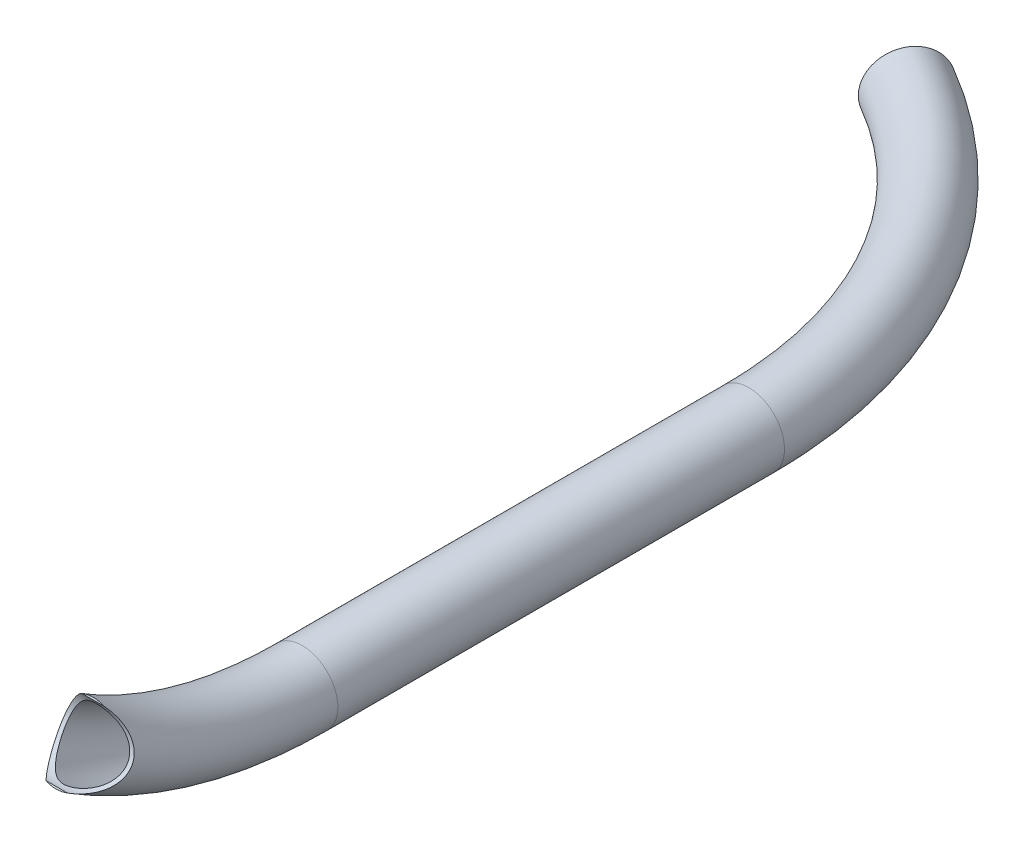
ISO-10303-21;
HEADER;
FILE_DESCRIPTION(('STEP AP214'),'2;1');
FILE_NAME('part.step','',(''),(''),'','','');
FILE_SCHEMA(('AUTOMOTIVE_DESIGN { 1 0 10303 214 1 1 1 1 }'));
ENDSEC;
DATA;
#1=APPLICATION_CONTEXT('core data for automotive mechanical design processes');
#2=APPLICATION_PROTOCOL_DEFINITION('international standard','automotive_design',2000,#1);
#3=PRODUCT_CONTEXT('',#1,'mechanical');
#4=PRODUCT('Part','Part','',(#3));
#5=PRODUCT_RELATED_PRODUCT_CATEGORY('part','',(#4));
#6=PRODUCT_DEFINITION_FORMATION('','',#4);
#7=PRODUCT_DEFINITION_CONTEXT('part definition',#1,'design');
#8=PRODUCT_DEFINITION('design','',#6,#7);
#9=PRODUCT_DEFINITION_SHAPE('','',#8);
#10=(LENGTH_UNIT() NAMED_UNIT(*) SI_UNIT(.MILLI.,.METRE.));
#11=(NAMED_UNIT(*) PLANE_ANGLE_UNIT() SI_UNIT($,.RADIAN.));
#12=(NAMED_UNIT(*) SI_UNIT($,.STERADIAN.) SOLID_ANGLE_UNIT());
#13=UNCERTAINTY_MEASURE_WITH_UNIT(LENGTH_MEASURE(1.E-05),#10,'distance_accuracy_value','');
#14=(GEOMETRIC_REPRESENTATION_CONTEXT(3) GLOBAL_UNCERTAINTY_ASSIGNED_CONTEXT((#13)) GLOBAL_UNIT_ASSIGNED_CONTEXT((#10,
#11,#12)) REPRESENTATION_CONTEXT('',''));
#15=CARTESIAN_POINT('',(0.,0.,0.));
#16=DIRECTION('',(0.,0.,1.));
#17=DIRECTION('',(1.,0.,0.));
#18=AXIS2_PLACEMENT_3D('',#15,#16,#17);
#19=CARTESIAN_POINT('',(200.000000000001,200.,0.));
#20=DIRECTION('',(1.,0.,0.));
#21=DIRECTION('',(0.,0.,1.));
#22=AXIS2_PLACEMENT_3D('',#19,#20,#21);
#23=TOROIDAL_SURFACE('',#22,200.,16.5);
#24=CARTESIAN_POINT('',(200.000000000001,0.,0.));
#25=DIRECTION('',(0.,0.,-1.));
#26=DIRECTION('',(-1.,0.,0.));
#27=AXIS2_PLACEMENT_3D('',#24,#25,#26);
#28=CIRCLE('',#27,16.5);
#29=CARTESIAN_POINT('',(183.500000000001,0.,0.));
#30=VERTEX_POINT('',#29);
#31=EDGE_CURVE('E93',#30,#30,#28,.T.);
#32=ORIENTED_EDGE('',*,*,#31,.F.);
#33=EDGE_LOOP('',(#32));
#34=FACE_BOUND('',#33,.T.);
#35=CARTESIAN_POINT('',(195.406106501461,16.7431104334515,114.048651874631));
#36=CARTESIAN_POINT('',(195.164971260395,16.6759406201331,113.808397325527));
#37=CARTESIAN_POINT('',(194.9254115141,16.6138245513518,113.565142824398));
#38=CARTESIAN_POINT('',(194.449342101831,16.5002227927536,113.07319060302));
#39=CARTESIAN_POINT('',(194.212832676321,16.4487379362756,112.824492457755));
#40=CARTESIAN_POINT('',(193.742504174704,16.3568742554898,112.321930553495));
#41=CARTESIAN_POINT('',(193.50868887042,16.3165095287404,112.068060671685));
#42=CARTESIAN_POINT('',(193.044218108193,16.2474347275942,111.555916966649));
#43=CARTESIAN_POINT('',(192.813562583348,16.218724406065,111.297643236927));
#44=CARTESIAN_POINT('',(192.122200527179,16.1503182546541,110.511757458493));
#45=CARTESIAN_POINT('',(191.666581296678,16.129240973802,109.977877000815));
#46=CARTESIAN_POINT('',(190.772086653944,16.1403170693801,108.897183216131));
#47=CARTESIAN_POINT('',(190.333202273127,16.1724415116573,108.350377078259));
#48=CARTESIAN_POINT('',(189.575273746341,16.2799595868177,107.37495182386));
#49=CARTESIAN_POINT('',(189.252020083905,16.3436059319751,106.948297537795));
#50=CARTESIAN_POINT('',(188.619855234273,16.5068492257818,106.091122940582));
#51=CARTESIAN_POINT('',(188.310944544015,16.6064474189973,105.660602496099));
#52=CARTESIAN_POINT('',(187.711181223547,16.8434120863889,104.799361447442));
#53=CARTESIAN_POINT('',(187.42027615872,16.9806618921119,104.368645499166));
#54=CARTESIAN_POINT('',(186.858825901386,17.2952555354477,103.508577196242));
#55=CARTESIAN_POINT('',(186.588275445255,17.4725889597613,103.079224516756));
#56=CARTESIAN_POINT('',(186.12897642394,17.825219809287,102.320487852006));
#57=CARTESIAN_POINT('',(185.935425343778,17.9921822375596,101.990127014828));
#58=CARTESIAN_POINT('',(185.565088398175,18.35239965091,101.334401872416));
#59=CARTESIAN_POINT('',(185.388298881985,18.5456488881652,101.009036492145));
#60=CARTESIAN_POINT('',(185.053850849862,18.9589543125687,100.365781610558));
#61=CARTESIAN_POINT('',(184.896183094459,19.1789974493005,100.047888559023));
#62=CARTESIAN_POINT('',(184.602382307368,19.6461755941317,99.422186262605));
#63=CARTESIAN_POINT('',(184.466245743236,19.8933061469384,99.1143753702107));
#64=CARTESIAN_POINT('',(184.238426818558,20.3715668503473,98.5613704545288));
#65=CARTESIAN_POINT('',(184.143115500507,20.5986733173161,98.3141866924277));
#66=CARTESIAN_POINT('',(183.970798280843,21.0709895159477,97.8310177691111));
#67=CARTESIAN_POINT('',(183.893788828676,21.3161957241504,97.5950304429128));
#68=CARTESIAN_POINT('',(183.75944113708,21.8236598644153,97.1363598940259));
#69=CARTESIAN_POINT('',(183.702093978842,22.0859100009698,96.913670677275));
#70=CARTESIAN_POINT('',(183.608162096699,22.6261645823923,96.4834975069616));
#71=CARTESIAN_POINT('',(183.571577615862,22.904169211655,96.2760137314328));
#72=CARTESIAN_POINT('',(183.519914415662,23.4751453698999,95.8774215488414));
#73=CARTESIAN_POINT('',(183.504915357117,23.7681682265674,95.6863762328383));
#74=CARTESIAN_POINT('',(183.497132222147,24.3659969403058,95.3231948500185));
#75=CARTESIAN_POINT('',(183.504348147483,24.670802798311,95.1510587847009));
#76=CARTESIAN_POINT('',(183.541008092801,25.2896877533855,94.8270123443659));
#77=CARTESIAN_POINT('',(183.570452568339,25.6037670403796,94.6751023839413));
#78=CARTESIAN_POINT('',(183.651139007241,26.2385406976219,94.3924019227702));
#79=CARTESIAN_POINT('',(183.702380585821,26.5592349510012,94.2616110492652));
#80=CARTESIAN_POINT('',(183.822365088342,27.1865260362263,94.0282952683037));
#81=CARTESIAN_POINT('',(183.889968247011,27.492907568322,93.924598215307));
#82=CARTESIAN_POINT('',(184.042876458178,28.1070997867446,93.7364045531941));
#83=CARTESIAN_POINT('',(184.12818031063,28.4149103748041,93.6519066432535));
#84=CARTESIAN_POINT('',(184.315358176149,29.0301322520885,93.5017852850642));
#85=CARTESIAN_POINT('',(184.417235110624,29.3375434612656,93.4361651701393));
#86=CARTESIAN_POINT('',(184.636295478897,29.9502929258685,93.3232550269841));
#87=CARTESIAN_POINT('',(184.753482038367,30.2556307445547,93.2759687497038));
#88=CARTESIAN_POINT('',(185.049293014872,30.9787578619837,93.1843203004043));
#89=CARTESIAN_POINT('',(185.234292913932,31.3949757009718,93.1479662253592));
#90=CARTESIAN_POINT('',(185.627638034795,32.217824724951,93.1066366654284));
#91=CARTESIAN_POINT('',(185.835990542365,32.6244528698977,93.1016710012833));
#92=CARTESIAN_POINT('',(186.273172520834,33.4266284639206,93.1207006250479));
#93=CARTESIAN_POINT('',(186.502034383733,33.8221570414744,93.1447425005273));
#94=CARTESIAN_POINT('',(186.977029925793,34.6000100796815,93.2194339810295));
#95=CARTESIAN_POINT('',(187.223164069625,34.9823341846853,93.2700843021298));
#96=CARTESIAN_POINT('',(187.831895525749,35.883520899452,93.420915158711));
#97=CARTESIAN_POINT('',(188.201607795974,36.3956402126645,93.532813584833));
#98=CARTESIAN_POINT('',(188.964025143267,37.3910559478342,93.7987799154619));
#99=CARTESIAN_POINT('',(189.356740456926,37.8743393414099,93.9528667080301));
#100=CARTESIAN_POINT('',(190.160866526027,38.8124083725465,94.2988090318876));
#101=CARTESIAN_POINT('',(190.572310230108,39.2671401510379,94.4907332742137));
#102=CARTESIAN_POINT('',(191.408969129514,40.1471830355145,94.9083074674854));
#103=CARTESIAN_POINT('',(191.834180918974,40.5725013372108,95.1339491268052));
#104=CARTESIAN_POINT('',(192.55795592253,41.2636656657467,95.5394505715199));
#105=CARTESIAN_POINT('',(192.853827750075,41.5372398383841,95.7110739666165));
#106=CARTESIAN_POINT('',(193.449119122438,42.0711874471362,96.0680371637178));
#107=CARTESIAN_POINT('',(193.748538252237,42.3315624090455,96.2533753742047));
#108=CARTESIAN_POINT('',(194.34762418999,42.8377327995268,96.6361064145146));
#109=CARTESIAN_POINT('',(194.64727525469,43.0836158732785,96.8334079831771));
#110=CARTESIAN_POINT('',(195.097204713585,43.4433379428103,97.1393360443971));
#111=CARTESIAN_POINT('',(195.247260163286,43.56173085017,97.2429772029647));
#112=CARTESIAN_POINT('',(195.547211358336,43.7956113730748,97.453709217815));
#113=CARTESIAN_POINT('',(195.697107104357,43.9110990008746,97.5608000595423));
#114=CARTESIAN_POINT('',(195.846769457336,44.0252,97.6696790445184));
#115=B_SPLINE_CURVE_WITH_KNOTS('',3,(#35,#36,#37,#38,#39,#40,#41,#42,#43,#44,#45,#46,#47,#48,
#49,#50,#51,#52,#53,#54,#55,#56,#57,#58,#59,#60,#61,#62,#63,#64,#65,#66,#67,#68,#69,#70,#71,#72,
#73,#74,#75,#76,#77,#78,#79,#80,#81,#82,#83,#84,#85,#86,#87,#88,#89,#90,#91,#92,#93,#94,#95,#96,
#97,#98,#99,#100,#101,#102,#103,#104,#105,#106,#107,#108,#109,#110,#111,#112,#113,#114),
.UNSPECIFIED.,.F.,.F.,(4,2,2,2,2,2,2,2,2,2,2,2,2,2,2,2,2,2,2,2,2,2,2,2,2,2,2,2,2,2,2,2,2,2,2,2,
2,2,2,4),(0.,1.04082705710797,2.08173566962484,3.12395788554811,4.16615799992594,
6.27038423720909,8.37346645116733,9.9893650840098,11.6053196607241,13.2163224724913,
14.8269072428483,16.0789506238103,17.3307206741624,18.5818834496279,19.8328407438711,
20.87862323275,21.9242026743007,22.9693072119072,24.0144239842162,25.0633879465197,
26.1123519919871,27.1613375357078,28.2103045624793,29.2005747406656,30.1907778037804,
31.1811556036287,32.1717359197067,33.54048666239,34.9096656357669,36.281046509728,
37.6524642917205,39.5739587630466,41.4963149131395,43.4221946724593,45.3476016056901,
46.6611778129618,47.9746018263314,49.2790297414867,49.9312739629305,50.583515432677),.UNSPECIFIED.);
#116=CARTESIAN_POINT('',(195.000000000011,16.6344425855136,113.639766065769));
#117=VERTEX_POINT('',#116);
#118=CARTESIAN_POINT('',(195.000000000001,43.3655574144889,97.0733089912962));
#119=VERTEX_POINT('',#118);
#120=EDGE_CURVE('E78',#117,#119,#115,.T.);
#121=ORIENTED_EDGE('',*,*,#120,.T.);
#122=CARTESIAN_POINT('',(200.000000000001,30.,105.356537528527));
#123=DIRECTION('',(0.,-0.526782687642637,-0.85));
#124=DIRECTION('',(-1.,0.,0.));
#125=AXIS2_PLACEMENT_3D('',#122,#123,#124);
#126=CIRCLE('',#125,16.5);
#127=CARTESIAN_POINT('',(205.000000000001,43.3655574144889,97.0733089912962));
#128=VERTEX_POINT('',#127);
#129=EDGE_CURVE('E76',#119,#128,#126,.T.);
#130=ORIENTED_EDGE('',*,*,#129,.T.);
#131=CARTESIAN_POINT('',(204.153230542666,44.0252,97.6696790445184));
#132=CARTESIAN_POINT('',(204.391526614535,43.8436089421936,97.4964271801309));
#133=CARTESIAN_POINT('',(204.630317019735,43.6584441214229,97.3276031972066));
#134=CARTESIAN_POINT('',(205.107874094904,43.2805708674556,96.9985354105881));
#135=CARTESIAN_POINT('',(205.346640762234,43.0878619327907,96.838292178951));
#136=CARTESIAN_POINT('',(205.823409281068,42.6942780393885,96.5259345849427));
#137=CARTESIAN_POINT('',(206.061409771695,42.4933929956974,96.3738308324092));
#138=CARTESIAN_POINT('',(206.535642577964,42.0835074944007,96.0780843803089));
#139=CARTESIAN_POINT('',(206.771874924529,41.8745071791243,95.9344415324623));
#140=CARTESIAN_POINT('',(207.481991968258,41.2305594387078,95.5135364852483));
#141=CARTESIAN_POINT('',(207.95228407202,40.782771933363,95.2495733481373));
#142=CARTESIAN_POINT('',(208.878232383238,39.8527546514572,94.7601833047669));
#143=CARTESIAN_POINT('',(209.333896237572,39.3705433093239,94.5347359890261));
#144=CARTESIAN_POINT('',(210.119649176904,38.4900214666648,94.1752331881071));
#145=CARTESIAN_POINT('',(210.4538337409,38.099026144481,94.0321933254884));
#146=CARTESIAN_POINT('',(211.108300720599,37.2967204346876,93.773474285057));
#147=CARTESIAN_POINT('',(211.428582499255,36.8854091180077,93.6577963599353));
#148=CARTESIAN_POINT('',(212.051180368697,36.044201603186,93.4570377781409));
#149=CARTESIAN_POINT('',(212.35354921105,35.6143671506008,93.3718631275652));
#150=CARTESIAN_POINT('',(212.937790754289,34.7358410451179,93.2349333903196));
#151=CARTESIAN_POINT('',(213.219668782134,34.2871543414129,93.1831695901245));
#152=CARTESIAN_POINT('',(213.698970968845,33.4740005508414,93.1240753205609));
#153=CARTESIAN_POINT('',(213.901260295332,33.1129257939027,93.1094362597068));
#154=CARTESIAN_POINT('',(214.28867431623,32.3815497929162,93.104417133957));
#155=CARTESIAN_POINT('',(214.4738033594,32.0112509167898,93.1140309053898));
#156=CARTESIAN_POINT('',(214.824430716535,31.2632114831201,93.1593037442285));
#157=CARTESIAN_POINT('',(214.989939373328,30.885474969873,93.1949490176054));
#158=CARTESIAN_POINT('',(215.298875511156,30.1246147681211,93.2939503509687));
#159=CARTESIAN_POINT('',(215.442306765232,29.7414920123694,93.3573016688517));
#160=CARTESIAN_POINT('',(215.6829258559,29.0360833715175,93.5002360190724));
#161=CARTESIAN_POINT('',(215.783839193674,28.714174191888,93.5754249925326));
#162=CARTESIAN_POINT('',(215.967077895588,28.0705902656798,93.7466222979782));
#163=CARTESIAN_POINT('',(216.049405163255,27.7489154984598,93.8426284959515));
#164=CARTESIAN_POINT('',(216.194193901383,27.1082029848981,94.0556393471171));
#165=CARTESIAN_POINT('',(216.256664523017,26.7891640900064,94.172634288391));
#166=CARTESIAN_POINT('',(216.360802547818,26.1560344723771,94.4274887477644));
#167=CARTESIAN_POINT('',(216.402469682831,25.8419438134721,94.565348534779));
#168=CARTESIAN_POINT('',(216.464445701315,25.2203159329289,94.8617925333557));
#169=CARTESIAN_POINT('',(216.484688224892,24.9128019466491,95.0204394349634));
#170=CARTESIAN_POINT('',(216.503340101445,24.3078696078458,95.3570880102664));
#171=CARTESIAN_POINT('',(216.501749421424,24.0104512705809,95.5350897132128));
#172=CARTESIAN_POINT('',(216.476919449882,23.4280301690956,95.9090379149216));
#173=CARTESIAN_POINT('',(216.453677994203,23.1430286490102,96.1049862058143));
#174=CARTESIAN_POINT('',(216.386138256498,22.587508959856,96.5130831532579));
#175=CARTESIAN_POINT('',(216.341840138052,22.3169906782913,96.7252316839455));
#176=CARTESIAN_POINT('',(216.235561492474,21.803798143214,97.1540120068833));
#177=CARTESIAN_POINT('',(216.174457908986,21.5604201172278,97.370021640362));
#178=CARTESIAN_POINT('',(216.034950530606,21.0894583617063,97.8133132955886));
#179=CARTESIAN_POINT('',(215.956547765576,20.861873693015,98.0405946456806));
#180=CARTESIAN_POINT('',(215.783611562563,20.4231540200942,98.5047645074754));
#181=CARTESIAN_POINT('',(215.689074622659,20.212022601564,98.7416550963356));
#182=CARTESIAN_POINT('',(215.485138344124,19.8066360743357,99.223372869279));
#183=CARTESIAN_POINT('',(215.375736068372,19.6123843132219,99.4682016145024));
#184=CARTESIAN_POINT('',(215.09946961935,19.1707898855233,100.057902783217));
#185=CARTESIAN_POINT('',(214.926502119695,18.931080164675,100.405658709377));
#186=CARTESIAN_POINT('',(214.558018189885,18.4837047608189,101.109731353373));
#187=CARTESIAN_POINT('',(214.362495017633,18.2760487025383,101.466050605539));
#188=CARTESIAN_POINT('',(213.951613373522,17.891715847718,102.184686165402));
#189=CARTESIAN_POINT('',(213.736226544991,17.7150844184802,102.547010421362));
#190=CARTESIAN_POINT('',(213.288557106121,17.3920368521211,103.27458087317));
#191=CARTESIAN_POINT('',(213.056274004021,17.245621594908,103.639827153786));
#192=CARTESIAN_POINT('',(212.494171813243,16.9359901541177,104.497809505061));
#193=CARTESIAN_POINT('',(212.158422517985,16.7845014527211,104.990912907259));
#194=CARTESIAN_POINT('',(211.465305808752,16.5305849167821,105.974594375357));
#195=CARTESIAN_POINT('',(211.107930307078,16.4281755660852,106.465171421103));
#196=CARTESIAN_POINT('',(210.374870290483,16.2691077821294,107.441332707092));
#197=CARTESIAN_POINT('',(209.999153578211,16.2125331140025,107.926906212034));
#198=CARTESIAN_POINT('',(209.233224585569,16.1424453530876,108.889419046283));
#199=CARTESIAN_POINT('',(208.843015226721,16.1289236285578,109.366360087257));
#200=CARTESIAN_POINT('',(208.137434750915,16.1406966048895,110.205963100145));
#201=CARTESIAN_POINT('',(207.824417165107,16.1581293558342,110.570749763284));
#202=CARTESIAN_POINT('',(207.191886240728,16.2163017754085,111.292705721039));
#203=CARTESIAN_POINT('',(206.872373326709,16.2570399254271,111.649875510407));
#204=CARTESIAN_POINT('',(206.229643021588,16.3602676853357,112.353147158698));
#205=CARTESIAN_POINT('',(205.906466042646,16.4226062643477,112.699308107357));
#206=CARTESIAN_POINT('',(205.417503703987,16.5315185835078,113.211160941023));
#207=CARTESIAN_POINT('',(205.253820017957,16.5703891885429,113.380543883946));
#208=CARTESIAN_POINT('',(204.92498025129,16.6530818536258,113.716645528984));
#209=CARTESIAN_POINT('',(204.759824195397,16.6969038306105,113.883364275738));
#210=CARTESIAN_POINT('',(204.593893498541,16.7431104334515,114.048651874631));
#211=B_SPLINE_CURVE_WITH_KNOTS('',3,(#131,#132,#133,#134,#135,#136,#137,#138,#139,#140,#141,
#142,#143,#144,#145,#146,#147,#148,#149,#150,#151,#152,#153,#154,#155,#156,#157,#158,#159,#160,
#161,#162,#163,#164,#165,#166,#167,#168,#169,#170,#171,#172,#173,#174,#175,#176,#177,#178,#179,
#180,#181,#182,#183,#184,#185,#186,#187,#188,#189,#190,#191,#192,#193,#194,#195,#196,#197,#198,
#199,#200,#201,#202,#203,#204,#205,#206,#207,#208,#209,#210),.UNSPECIFIED.,.F.,.F.,(4,2,2,2,2,2,
2,2,2,2,2,2,2,2,2,2,2,2,2,2,2,2,2,2,2,2,2,2,2,2,2,2,2,2,2,2,2,2,2,4),(0.,1.03821307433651,
2.07649527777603,3.11609947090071,4.15568543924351,6.2565925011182,8.35638281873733,
9.95686745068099,11.5574253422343,13.1530078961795,14.7481741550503,15.9895465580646,
17.2306035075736,18.471003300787,19.7111908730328,20.7470452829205,21.7827935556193,
22.8180637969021,23.8533473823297,24.8918283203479,25.9303108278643,26.9688971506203,
28.0074754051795,28.9997238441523,29.9919132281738,30.9843182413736,31.9769196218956,
33.3441502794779,34.7117906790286,36.0814146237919,37.4510784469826,39.2948461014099,
41.1393075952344,42.9871323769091,44.834586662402,46.276905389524,47.7191301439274,
49.1514677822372,49.86760862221,50.5837374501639),.UNSPECIFIED.);
#212=CARTESIAN_POINT('',(205.000000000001,16.634442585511,113.639766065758));
#213=VERTEX_POINT('',#212);
#214=EDGE_CURVE('E81',#128,#213,#211,.T.);
#215=ORIENTED_EDGE('',*,*,#214,.T.);
#216=EDGE_CURVE('E88',#213,#117,#126,.T.);
#217=ORIENTED_EDGE('',*,*,#216,.T.);
#218=EDGE_LOOP('',(#121,#130,#215,#217));
#219=FACE_BOUND('',#218,.T.);
#220=ADVANCED_FACE('F35',(#34,#219),#23,.T.);
#221=CARTESIAN_POINT('',(200.000000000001,30.,105.356537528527));
#222=DIRECTION('',(0.,0.526782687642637,0.85));
#223=DIRECTION('',(-1.,0.,0.));
#224=AXIS2_PLACEMENT_3D('',#221,#222,#223);
#225=PLANE('',#224);
#226=DIRECTION('',(-1.,0.,0.));
#227=VECTOR('',#226,1.);
#228=CARTESIAN_POINT('',(216.500000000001,16.634442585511,113.639766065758));
#229=LINE('',#228,#227);
#230=EDGE_CURVE('E84',#213,#117,#229,.T.);
#231=ORIENTED_EDGE('',*,*,#230,.T.);
#232=ORIENTED_EDGE('',*,*,#216,.F.);
#233=EDGE_LOOP('',(#231,#232));
#234=FACE_BOUND('',#233,.T.);
#235=ADVANCED_FACE('F109',(#234),#225,.T.);
#236=CARTESIAN_POINT('',(200.000000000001,0.,0.));
#237=DIRECTION('',(0.,0.,-1.));
#238=DIRECTION('',(1.,0.,0.));
#239=AXIS2_PLACEMENT_3D('',#236,#237,#238);
#240=CYLINDRICAL_SURFACE('',#239,16.5);
#241=CARTESIAN_POINT('',(200.000000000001,0.,-206.794919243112));
#242=DIRECTION('',(0.,0.,-1.));
#243=DIRECTION('',(-1.,0.,0.));
#244=AXIS2_PLACEMENT_3D('',#241,#242,#243);
#245=CIRCLE('',#244,16.5);
#246=CARTESIAN_POINT('',(183.500000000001,0.,-206.794919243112));
#247=VERTEX_POINT('',#246);
#248=EDGE_CURVE('E90',#247,#247,#245,.T.);
#249=ORIENTED_EDGE('',*,*,#248,.F.);
#250=EDGE_LOOP('',(#249));
#251=FACE_BOUND('',#250,.T.);
#252=ORIENTED_EDGE('',*,*,#31,.T.);
#253=EDGE_LOOP('',(#252));
#254=FACE_BOUND('',#253,.T.);
#255=ADVANCED_FACE('F106',(#251,#254),#240,.T.);
#256=CARTESIAN_POINT('',(9.99200722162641E-13,0.,-206.794919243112));
#257=DIRECTION('',(0.,-1.,0.));
#258=DIRECTION('',(0.,0.,-1.));
#259=AXIS2_PLACEMENT_3D('',#256,#257,#258);
#260=TOROIDAL_SURFACE('',#259,200.,16.5);
#261=CARTESIAN_POINT('',(100.000000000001,0.,-380.));
#262=DIRECTION('',(-0.86602540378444,0.,-0.499999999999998));
#263=DIRECTION('',(-0.499999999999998,0.,0.86602540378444));
#264=AXIS2_PLACEMENT_3D('',#261,#262,#263);
#265=CIRCLE('',#264,16.5);
#266=CARTESIAN_POINT('',(91.7500000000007,0.,-365.710580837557));
#267=VERTEX_POINT('',#266);
#268=EDGE_CURVE('E63',#267,#267,#265,.T.);
#269=ORIENTED_EDGE('',*,*,#268,.F.);
#270=EDGE_LOOP('',(#269));
#271=FACE_BOUND('',#270,.T.);
#272=ORIENTED_EDGE('',*,*,#248,.T.);
#273=EDGE_LOOP('',(#272));
#274=FACE_BOUND('',#273,.T.);
#275=ADVANCED_FACE('F37',(#271,#274),#260,.T.);
#276=CARTESIAN_POINT('',(100.000000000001,0.,-380.));
#277=DIRECTION('',(0.86602540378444,0.,0.499999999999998));
#278=DIRECTION('',(-0.499999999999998,0.,0.86602540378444));
#279=AXIS2_PLACEMENT_3D('',#276,#277,#278);
#280=PLANE('',#279);
#281=CARTESIAN_POINT('',(100.000000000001,0.,-380.));
#282=DIRECTION('',(-0.86602540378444,0.,-0.499999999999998));
#283=DIRECTION('',(-0.499999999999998,0.,0.86602540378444));
#284=AXIS2_PLACEMENT_3D('',#281,#282,#283);
#285=CIRCLE('',#284,14.5);
#286=CARTESIAN_POINT('',(92.7500000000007,0.,-367.442631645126));
#287=VERTEX_POINT('',#286);
#288=EDGE_CURVE('E11',#287,#287,#285,.F.);
#289=ORIENTED_EDGE('',*,*,#288,.T.);
#290=EDGE_LOOP('',(#289));
#291=FACE_BOUND('',#290,.T.);
#292=ORIENTED_EDGE('',*,*,#268,.T.);
#293=EDGE_LOOP('',(#292));
#294=FACE_BOUND('',#293,.T.);
#295=ADVANCED_FACE('F147',(#291,#294),#280,.F.);
#296=CARTESIAN_POINT('',(200.000000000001,0.,0.));
#297=DIRECTION('',(0.,0.,-1.));
#298=DIRECTION('',(1.,0.,0.));
#299=AXIS2_PLACEMENT_3D('',#296,#297,#298);
#300=CYLINDRICAL_SURFACE('',#299,14.5);
#301=CARTESIAN_POINT('',(200.000000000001,0.,-206.794919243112));
#302=DIRECTION('',(0.,0.,-1.));
#303=DIRECTION('',(-1.,0.,0.));
#304=AXIS2_PLACEMENT_3D('',#301,#302,#303);
#305=CIRCLE('',#304,14.5);
#306=CARTESIAN_POINT('',(185.500000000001,0.,-206.794919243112));
#307=VERTEX_POINT('',#306);
#308=EDGE_CURVE('E49',#307,#307,#305,.F.);
#309=ORIENTED_EDGE('',*,*,#308,.F.);
#310=EDGE_LOOP('',(#309));
#311=FACE_BOUND('',#310,.T.);
#312=CARTESIAN_POINT('',(200.000000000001,0.,0.));
#313=DIRECTION('',(0.,0.,-1.));
#314=DIRECTION('',(-1.,0.,0.));
#315=AXIS2_PLACEMENT_3D('',#312,#313,#314);
#316=CIRCLE('',#315,14.5);
#317=CARTESIAN_POINT('',(185.500000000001,0.,0.));
#318=VERTEX_POINT('',#317);
#319=EDGE_CURVE('E97',#318,#318,#316,.F.);
#320=ORIENTED_EDGE('',*,*,#319,.T.);
#321=EDGE_LOOP('',(#320));
#322=FACE_BOUND('',#321,.T.);
#323=ADVANCED_FACE('F118',(#311,#322),#300,.F.);
#324=CARTESIAN_POINT('',(9.99200722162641E-13,0.,-206.794919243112));
#325=DIRECTION('',(0.,-1.,0.));
#326=DIRECTION('',(0.,0.,-1.));
#327=AXIS2_PLACEMENT_3D('',#324,#325,#326);
#328=TOROIDAL_SURFACE('',#327,200.,14.5);
#329=ORIENTED_EDGE('',*,*,#288,.F.);
#330=EDGE_LOOP('',(#329));
#331=FACE_BOUND('',#330,.T.);
#332=ORIENTED_EDGE('',*,*,#308,.T.);
#333=EDGE_LOOP('',(#332));
#334=FACE_BOUND('',#333,.T.);
#335=ADVANCED_FACE('F140',(#331,#334),#328,.F.);
#336=DIRECTION('',(-1.,0.,0.));
#337=VECTOR('',#336,1.);
#338=CARTESIAN_POINT('',(216.500000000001,43.3655574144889,97.0733089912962));
#339=LINE('',#338,#337);
#340=EDGE_CURVE('E57',#119,#128,#339,.F.);
#341=ORIENTED_EDGE('',*,*,#340,.T.);
#342=ORIENTED_EDGE('',*,*,#129,.F.);
#343=EDGE_LOOP('',(#341,#342));
#344=FACE_BOUND('',#343,.T.);
#345=ADVANCED_FACE('F74',(#344),#225,.T.);
#346=CARTESIAN_POINT('',(200.000000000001,200.,0.));
#347=DIRECTION('',(1.,0.,0.));
#348=DIRECTION('',(0.,0.,1.));
#349=AXIS2_PLACEMENT_3D('',#346,#347,#348);
#350=TOROIDAL_SURFACE('',#349,200.,14.5);
#351=CARTESIAN_POINT('',(213.133409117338,19.5134191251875,99.6014073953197));
#352=CARTESIAN_POINT('',(213.263092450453,19.6970710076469,99.3605699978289));
#353=CARTESIAN_POINT('',(213.385027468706,19.889376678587,99.1221458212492));
#354=CARTESIAN_POINT('',(213.612002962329,20.2911889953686,98.6519617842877));
#355=CARTESIAN_POINT('',(213.717049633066,20.5006892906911,98.4201995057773));
#356=CARTESIAN_POINT('',(213.908923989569,20.9366141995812,97.9651258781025));
#357=CARTESIAN_POINT('',(213.995750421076,21.1630399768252,97.7418151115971));
#358=CARTESIAN_POINT('',(214.149845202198,21.6320724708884,97.3056416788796));
#359=CARTESIAN_POINT('',(214.217113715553,21.8746790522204,97.0927789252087));
#360=CARTESIAN_POINT('',(214.331224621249,22.3763096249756,96.6783521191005));
#361=CARTESIAN_POINT('',(214.377952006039,22.6354169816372,96.4768570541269));
#362=CARTESIAN_POINT('',(214.449482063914,23.1672197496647,96.0883968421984));
#363=CARTESIAN_POINT('',(214.474284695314,23.4399151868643,95.9014317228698));
#364=CARTESIAN_POINT('',(214.501352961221,23.996781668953,95.5438417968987));
#365=CARTESIAN_POINT('',(214.50362562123,24.2809491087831,95.373211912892));
#366=CARTESIAN_POINT('',(214.485454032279,24.8584857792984,95.0496743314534));
#367=CARTESIAN_POINT('',(214.465010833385,25.1518545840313,94.896765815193));
#368=CARTESIAN_POINT('',(214.403680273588,25.7262552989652,94.6188937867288));
#369=CARTESIAN_POINT('',(214.364184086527,26.0068762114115,94.492768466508));
#370=CARTESIAN_POINT('',(214.266028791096,26.5718125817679,94.2574476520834));
#371=CARTESIAN_POINT('',(214.207370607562,26.8561278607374,94.1482513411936));
#372=CARTESIAN_POINT('',(214.071664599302,27.4264482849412,93.9469146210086));
#373=CARTESIAN_POINT('',(213.994613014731,27.7124537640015,93.8547777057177));
#374=CARTESIAN_POINT('',(213.823112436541,28.2841822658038,93.6874113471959));
#375=CARTESIAN_POINT('',(213.728662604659,28.5699052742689,93.6121827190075));
#376=CARTESIAN_POINT('',(213.519367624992,29.1507437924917,93.4755091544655));
#377=CARTESIAN_POINT('',(213.403857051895,29.4457770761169,93.4147370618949));
#378=CARTESIAN_POINT('',(213.156539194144,30.0319712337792,93.3102634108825));
#379=CARTESIAN_POINT('',(213.024731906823,30.3231321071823,93.2665618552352));
#380=CARTESIAN_POINT('',(212.746122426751,30.9001764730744,93.1953014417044));
#381=CARTESIAN_POINT('',(212.599320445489,31.1860600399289,93.1677423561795));
#382=CARTESIAN_POINT('',(212.29193863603,31.751428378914,93.1277154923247));
#383=CARTESIAN_POINT('',(212.131355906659,32.0309117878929,93.1152509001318));
#384=CARTESIAN_POINT('',(211.712536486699,32.7229760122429,93.1015280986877));
#385=CARTESIAN_POINT('',(211.446206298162,33.1308751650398,93.1092063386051));
#386=CARTESIAN_POINT('',(210.888021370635,33.9273375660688,93.1524724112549));
#387=CARTESIAN_POINT('',(210.596155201,34.3158920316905,93.1880728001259));
#388=CARTESIAN_POINT('',(209.98826052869,35.0729844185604,93.2833322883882));
#389=CARTESIAN_POINT('',(209.672141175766,35.4414372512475,93.3430858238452));
#390=CARTESIAN_POINT('',(209.018483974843,36.1546214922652,93.4824378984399));
#391=CARTESIAN_POINT('',(208.680950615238,36.4993578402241,93.5620322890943));
#392=CARTESIAN_POINT('',(207.976867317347,37.1708137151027,93.7386523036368));
#393=CARTESIAN_POINT('',(207.609820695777,37.4969163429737,93.8360448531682));
#394=CARTESIAN_POINT('',(206.853337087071,38.118916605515,94.0414470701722));
#395=CARTESIAN_POINT('',(206.463885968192,38.4147948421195,94.1494634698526));
#396=CARTESIAN_POINT('',(205.662812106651,38.9699143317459,94.3686418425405));
#397=CARTESIAN_POINT('',(205.251293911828,39.2293103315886,94.479787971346));
#398=CARTESIAN_POINT('',(204.614852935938,39.5855623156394,94.6418547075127));
#399=CARTESIAN_POINT('',(204.399624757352,39.6987907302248,94.6950760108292));
#400=CARTESIAN_POINT('',(203.962397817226,39.9128748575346,94.7984046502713));
#401=CARTESIAN_POINT('',(203.740401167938,40.0137343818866,94.8485129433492));
#402=CARTESIAN_POINT('',(203.309445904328,40.1930021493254,94.9395886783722));
#403=CARTESIAN_POINT('',(203.101076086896,40.2726080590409,94.9809726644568));
#404=CARTESIAN_POINT('',(202.678672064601,40.4184751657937,95.0580871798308));
#405=CARTESIAN_POINT('',(202.46463850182,40.4847378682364,95.0938183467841));
#406=CARTESIAN_POINT('',(202.031951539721,40.6020191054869,95.1578781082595));
#407=CARTESIAN_POINT('',(201.813312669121,40.6530795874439,95.1862270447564));
#408=CARTESIAN_POINT('',(201.371854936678,40.7384933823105,95.2340570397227));
#409=CARTESIAN_POINT('',(201.149037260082,40.7728513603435,95.2535405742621));
#410=CARTESIAN_POINT('',(200.698222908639,40.8237793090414,95.2825373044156));
#411=CARTESIAN_POINT('',(200.470196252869,40.8401511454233,95.2919394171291));
#412=CARTESIAN_POINT('',(200.013390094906,40.8536787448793,95.2997026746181));
#413=CARTESIAN_POINT('',(199.784610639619,40.8508356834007,95.2980644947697));
#414=CARTESIAN_POINT('',(199.32816239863,40.8260550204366,95.2838627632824));
#415=CARTESIAN_POINT('',(199.1004953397,40.8040937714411,95.271285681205));
#416=CARTESIAN_POINT('',(198.64844549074,40.7420315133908,95.2360930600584));
#417=CARTESIAN_POINT('',(198.424063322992,40.7019271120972,95.2134756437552));
#418=CARTESIAN_POINT('',(197.929718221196,40.5941712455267,95.1535482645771));
#419=CARTESIAN_POINT('',(197.660933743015,40.5223392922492,95.1140714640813));
#420=CARTESIAN_POINT('',(197.13166971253,40.3569973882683,95.0252910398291));
#421=CARTESIAN_POINT('',(196.871197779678,40.2634681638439,94.9759786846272));
#422=CARTESIAN_POINT('',(196.358359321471,40.0576127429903,94.8704564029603));
#423=CARTESIAN_POINT('',(196.106019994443,39.9452299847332,94.8142258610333));
#424=CARTESIAN_POINT('',(195.610184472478,39.7045706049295,94.6976904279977));
#425=CARTESIAN_POINT('',(195.366686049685,39.5762980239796,94.6373865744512));
#426=CARTESIAN_POINT('',(194.707614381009,39.2041148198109,94.4688409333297));
#427=CARTESIAN_POINT('',(194.300586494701,38.9458811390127,94.3587061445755));
#428=CARTESIAN_POINT('',(193.509479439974,38.3948948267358,94.1420928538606));
#429=CARTESIAN_POINT('',(193.125416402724,38.102118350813,94.0356169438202));
#430=CARTESIAN_POINT('',(192.378360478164,37.4864972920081,93.832900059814));
#431=CARTESIAN_POINT('',(192.01539899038,37.163609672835,93.7366741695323));
#432=CARTESIAN_POINT('',(191.310905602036,36.4914184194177,93.5600280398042));
#433=CARTESIAN_POINT('',(190.969368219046,36.1421215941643,93.4796037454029));
#434=CARTESIAN_POINT('',(190.291447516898,35.4008795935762,93.3355926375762));
#435=CARTESIAN_POINT('',(189.956216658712,35.0076676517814,93.2730745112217));
#436=CARTESIAN_POINT('',(189.312051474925,34.1967601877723,93.1756422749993));
#437=CARTESIAN_POINT('',(189.00312325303,33.7790590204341,93.1407345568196));
#438=CARTESIAN_POINT('',(188.415728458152,32.9231386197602,93.1035282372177));
#439=CARTESIAN_POINT('',(188.137171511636,32.4849861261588,93.1011301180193));
#440=CARTESIAN_POINT('',(187.613724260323,31.5904015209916,93.1334960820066));
#441=CARTESIAN_POINT('',(187.368812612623,31.1339812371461,93.1682364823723));
#442=CARTESIAN_POINT('',(186.995695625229,30.3677959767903,93.2600427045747));
#443=CARTESIAN_POINT('',(186.85643167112,30.0619352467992,93.3052232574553));
#444=CARTESIAN_POINT('',(186.595911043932,29.4459694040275,93.4144171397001));
#445=CARTESIAN_POINT('',(186.474649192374,29.1358655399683,93.4784250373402));
#446=CARTESIAN_POINT('',(186.251681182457,28.5134546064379,93.6261097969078));
#447=CARTESIAN_POINT('',(186.149966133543,28.2011486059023,93.7097776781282));
#448=CARTESIAN_POINT('',(185.967459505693,27.5764509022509,93.8973551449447));
#449=CARTESIAN_POINT('',(185.886668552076,27.2640591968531,94.0012653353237));
#450=CARTESIAN_POINT('',(185.746837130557,26.6398325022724,94.2301864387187));
#451=CARTESIAN_POINT('',(185.68793398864,26.3280128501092,94.3553236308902));
#452=CARTESIAN_POINT('',(185.593545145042,25.7096721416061,94.6259247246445));
#453=CARTESIAN_POINT('',(185.558059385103,25.4031510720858,94.7713885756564));
#454=CARTESIAN_POINT('',(185.511053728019,24.7983021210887,95.0817753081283));
#455=CARTESIAN_POINT('',(185.499529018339,24.4999726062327,95.2466942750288));
#456=CARTESIAN_POINT('',(185.50050041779,23.9141576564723,95.5946887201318));
#457=CARTESIAN_POINT('',(185.512995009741,23.6266715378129,95.7777630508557));
#458=CARTESIAN_POINT('',(185.559349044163,23.0907377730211,96.1427677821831));
#459=CARTESIAN_POINT('',(185.591143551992,22.8411281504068,96.3232626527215));
#460=CARTESIAN_POINT('',(185.673569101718,22.35435671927,96.6962810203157));
#461=CARTESIAN_POINT('',(185.724198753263,22.1171939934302,96.8888036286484));
#462=CARTESIAN_POINT('',(185.843444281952,21.6564711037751,97.2842832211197));
#463=CARTESIAN_POINT('',(185.912061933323,21.432912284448,97.4872412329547));
#464=CARTESIAN_POINT('',(186.066259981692,21.0002593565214,97.9019273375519));
#465=CARTESIAN_POINT('',(186.151841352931,20.791166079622,98.113655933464));
#466=CARTESIAN_POINT('',(186.343492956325,20.3779723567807,98.5549424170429));
#467=CARTESIAN_POINT('',(186.450369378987,20.1746350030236,98.7848636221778));
#468=CARTESIAN_POINT('',(186.680249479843,19.7847745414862,99.2507703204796));
#469=CARTESIAN_POINT('',(186.803253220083,19.5982514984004,99.4867558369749));
#470=CARTESIAN_POINT('',(187.064117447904,19.2419751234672,99.9631730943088));
#471=CARTESIAN_POINT('',(187.201980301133,19.0722244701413,100.203605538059));
#472=CARTESIAN_POINT('',(187.491348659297,18.7492700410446,100.687383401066));
#473=CARTESIAN_POINT('',(187.642856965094,18.5960696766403,100.930729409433));
#474=CARTESIAN_POINT('',(188.036395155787,18.234116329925,101.539579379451));
#475=CARTESIAN_POINT('',(188.286166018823,18.0353119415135,101.906037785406));
#476=CARTESIAN_POINT('',(188.810620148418,17.6719854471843,102.638189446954));
#477=CARTESIAN_POINT('',(189.085313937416,17.5074779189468,103.003882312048));
#478=CARTESIAN_POINT('',(189.658094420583,17.2101727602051,103.731743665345));
#479=CARTESIAN_POINT('',(189.956250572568,17.0774743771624,104.09389782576));
#480=CARTESIAN_POINT('',(190.573587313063,16.8420590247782,104.809739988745));
#481=CARTESIAN_POINT('',(190.892764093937,16.7393366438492,105.163429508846));
#482=CARTESIAN_POINT('',(191.558347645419,16.55939830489,105.865684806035));
#483=CARTESIAN_POINT('',(191.905181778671,16.4827553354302,106.213992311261));
#484=CARTESIAN_POINT('',(192.620542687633,16.3549265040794,106.892881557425));
#485=CARTESIAN_POINT('',(192.98907977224,16.3037528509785,107.22345472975));
#486=CARTESIAN_POINT('',(193.748063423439,16.2235933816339,107.859132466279));
#487=CARTESIAN_POINT('',(194.138437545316,16.1945383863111,108.164313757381));
#488=CARTESIAN_POINT('',(194.742795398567,16.1642373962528,108.596226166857));
#489=CARTESIAN_POINT('',(194.947303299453,16.1563511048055,108.735841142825));
#490=CARTESIAN_POINT('',(195.363049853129,16.1443411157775,109.004809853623));
#491=CARTESIAN_POINT('',(195.574286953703,16.1402165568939,109.134165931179));
#492=CARTESIAN_POINT('',(195.986742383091,16.1352076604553,109.370770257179));
#493=CARTESIAN_POINT('',(196.187416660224,16.1340911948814,109.478958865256));
#494=CARTESIAN_POINT('',(196.594964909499,16.1337752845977,109.682990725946));
#495=CARTESIAN_POINT('',(196.801838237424,16.1345756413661,109.778835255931));
#496=CARTESIAN_POINT('',(197.2214417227,16.1373729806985,109.955793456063));
#497=CARTESIAN_POINT('',(197.434161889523,16.1393680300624,110.036930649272));
#498=CARTESIAN_POINT('',(197.865322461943,16.143796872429,110.18216352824));
#499=CARTESIAN_POINT('',(198.083761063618,16.1462305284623,110.246264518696));
#500=CARTESIAN_POINT('',(198.528955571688,16.1508420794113,110.355826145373));
#501=CARTESIAN_POINT('',(198.755788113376,16.1530153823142,110.400979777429));
#502=CARTESIAN_POINT('',(199.212800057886,16.1564330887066,110.468987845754));
#503=CARTESIAN_POINT('',(199.442979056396,16.1576776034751,110.491844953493));
#504=CARTESIAN_POINT('',(199.904324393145,16.1588828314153,110.514004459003));
#505=CARTESIAN_POINT('',(200.135489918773,16.1588444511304,110.513323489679));
#506=CARTESIAN_POINT('',(200.596538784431,16.1574962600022,110.488482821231));
#507=CARTESIAN_POINT('',(200.826422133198,16.1561864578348,110.464323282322));
#508=CARTESIAN_POINT('',(201.248541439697,16.152934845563,110.399135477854));
#509=CARTESIAN_POINT('',(201.441263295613,16.1511169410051,110.361172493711));
#510=CARTESIAN_POINT('',(201.823252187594,16.1472182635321,110.270570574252));
#511=CARTESIAN_POINT('',(202.012517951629,16.1451373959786,110.21792634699));
#512=CARTESIAN_POINT('',(202.574354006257,16.1391887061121,110.040209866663));
#513=CARTESIAN_POINT('',(202.940749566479,16.1356173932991,109.895389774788));
#514=CARTESIAN_POINT('',(203.635620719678,16.1332093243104,109.574732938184));
#515=CARTESIAN_POINT('',(203.965076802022,16.1341313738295,109.400950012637));
#516=CARTESIAN_POINT('',(204.608281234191,16.1430552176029,109.026215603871));
#517=CARTESIAN_POINT('',(204.922016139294,16.1510629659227,108.825241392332));
#518=CARTESIAN_POINT('',(205.535909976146,16.1765760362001,108.401877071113));
#519=CARTESIAN_POINT('',(205.836012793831,16.194117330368,108.179408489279));
#520=CARTESIAN_POINT('',(206.422548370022,16.2406557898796,107.718462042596));
#521=CARTESIAN_POINT('',(206.708983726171,16.2696507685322,107.4799872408));
#522=CARTESIAN_POINT('',(207.397144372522,16.3569841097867,106.878685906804));
#523=CARTESIAN_POINT('',(207.791801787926,16.422675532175,106.508793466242));
#524=CARTESIAN_POINT('',(208.555767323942,16.5862015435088,105.750134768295));
#525=CARTESIAN_POINT('',(208.9250631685,16.6840515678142,105.36135952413));
#526=CARTESIAN_POINT('',(209.636973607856,16.9153842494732,104.572005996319));
#527=CARTESIAN_POINT('',(209.979654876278,17.0487738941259,104.171460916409));
#528=CARTESIAN_POINT('',(210.637464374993,17.3546082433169,103.363170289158));
#529=CARTESIAN_POINT('',(210.95260893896,17.527029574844,102.955429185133));
#530=CARTESIAN_POINT('',(211.61554984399,17.9547809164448,102.051942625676));
#531=CARTESIAN_POINT('',(211.95642310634,18.2199052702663,101.555599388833));
#532=CARTESIAN_POINT('',(212.428718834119,18.6671654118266,100.816597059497));
#533=CARTESIAN_POINT('',(212.579667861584,18.8245413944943,100.571145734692));
#534=CARTESIAN_POINT('',(212.867439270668,19.1562276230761,100.083468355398));
#535=CARTESIAN_POINT('',(213.004266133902,19.3305324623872,99.8412412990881));
#536=CARTESIAN_POINT('',(213.133409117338,19.5134191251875,99.6014073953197));
#537=B_SPLINE_CURVE_WITH_KNOTS('',3,(#351,#352,#353,#354,#355,#356,#357,#358,#359,#360,#361,
#362,#363,#364,#365,#366,#367,#368,#369,#370,#371,#372,#373,#374,#375,#376,#377,#378,#379,#380,
#381,#382,#383,#384,#385,#386,#387,#388,#389,#390,#391,#392,#393,#394,#395,#396,#397,#398,#399,
#400,#401,#402,#403,#404,#405,#406,#407,#408,#409,#410,#411,#412,#413,#414,#415,#416,#417,#418,
#419,#420,#421,#422,#423,#424,#425,#426,#427,#428,#429,#430,#431,#432,#433,#434,#435,#436,#437,
#438,#439,#440,#441,#442,#443,#444,#445,#446,#447,#448,#449,#450,#451,#452,#453,#454,#455,#456,
#457,#458,#459,#460,#461,#462,#463,#464,#465,#466,#467,#468,#469,#470,#471,#472,#473,#474,#475,
#476,#477,#478,#479,#480,#481,#482,#483,#484,#485,#486,#487,#488,#489,#490,#491,#492,#493,#494,
#495,#496,#497,#498,#499,#500,#501,#502,#503,#504,#505,#506,#507,#508,#509,#510,#511,#512,#513,
#514,#515,#516,#517,#518,#519,#520,#521,#522,#523,#524,#525,#526,#527,#528,#529,#530,#531,#532,
#533,#534,#535,#536),.UNSPECIFIED.,.T.,.F.,(4,2,2,2,2,2,2,2,2,2,2,2,2,2,2,2,2,2,2,2,2,2,2,2,2,2,
2,2,2,2,2,2,2,2,2,2,2,2,2,2,2,2,2,2,2,2,2,2,2,2,2,2,2,2,2,2,2,2,2,2,2,2,2,2,2,2,2,2,2,2,2,2,2,2,
2,2,2,2,2,2,2,2,2,2,2,2,2,2,2,2,2,2,4),(0.,0.98817755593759,1.97599177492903,2.96387397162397,
3.95174789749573,4.94508448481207,5.93842296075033,6.93145167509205,7.9244344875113,
8.85390893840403,9.78333853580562,10.7129582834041,11.6426228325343,12.6095270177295,
13.57643136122,14.5433220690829,15.5104168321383,16.9698867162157,18.430013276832,
19.8959048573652,21.361490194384,22.8616504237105,24.3627674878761,25.8573117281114,
26.6038352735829,27.3501281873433,28.0302626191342,28.710320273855,29.388483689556,
30.0664575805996,30.7518273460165,31.4371551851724,32.1233319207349,32.8096370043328,
33.651282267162,34.4936780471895,35.3386478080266,36.18340314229,37.6644844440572,
39.1465941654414,40.6308556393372,42.1147357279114,43.6743406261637,45.2343064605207,
46.7894958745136,48.3436941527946,49.3600831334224,50.3761791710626,51.3918119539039,
52.407475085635,53.4294070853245,54.4513365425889,55.4730607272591,56.4947203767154,
57.4226630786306,58.3505372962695,59.2785030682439,60.2065221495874,61.1806086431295,
62.1546988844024,63.128944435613,64.1033904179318,65.5592654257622,67.0157579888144,
68.4767374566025,69.9374530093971,71.4284539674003,72.9201689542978,74.4071990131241,
75.1501758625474,75.8929825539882,76.5765639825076,77.2600746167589,77.9424822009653,
78.6246770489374,79.3175344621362,80.0103088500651,80.7025937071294,81.3948738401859,
81.9835594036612,82.5724574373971,83.7508968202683,84.8667992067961,85.983640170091,
87.1047247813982,88.2255954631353,89.8581958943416,91.4915810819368,93.1207327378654,
94.7489113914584,96.7170747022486,97.7014481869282,98.6855083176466),.UNSPECIFIED.);
#538=CARTESIAN_POINT('',(213.133409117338,19.5134191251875,99.6014073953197));
#539=VERTEX_POINT('',#538);
#540=EDGE_CURVE('E39',#539,#539,#537,.T.);
#541=ORIENTED_EDGE('',*,*,#540,.T.);
#542=EDGE_LOOP('',(#541));
#543=FACE_BOUND('',#542,.T.);
#544=ORIENTED_EDGE('',*,*,#319,.F.);
#545=EDGE_LOOP('',(#544));
#546=FACE_BOUND('',#545,.T.);
#547=ADVANCED_FACE('F131',(#543,#546),#350,.F.);
#548=CARTESIAN_POINT('',(216.500000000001,32.6339134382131,109.606537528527));
#549=DIRECTION('',(-1.,0.,0.));
#550=DIRECTION('',(0.,0.,-1.));
#551=AXIS2_PLACEMENT_3D('',#548,#549,#550);
#552=CYLINDRICAL_SURFACE('',#551,16.5);
#553=ORIENTED_EDGE('',*,*,#214,.F.);
#554=ORIENTED_EDGE('',*,*,#340,.F.);
#555=ORIENTED_EDGE('',*,*,#120,.F.);
#556=ORIENTED_EDGE('',*,*,#230,.F.);
#557=EDGE_LOOP('',(#553,#554,#555,#556));
#558=FACE_BOUND('',#557,.T.);
#559=ORIENTED_EDGE('',*,*,#540,.F.);
#560=EDGE_LOOP('',(#559));
#561=FACE_BOUND('',#560,.T.);
#562=ADVANCED_FACE('F82',(#558,#561),#552,.F.);
#563=CLOSED_SHELL('',(#220,#235,#255,#275,#295,#323,#335,#345,#547,#562));
#564=MANIFOLD_SOLID_BREP('B2',#563);
#565=ADVANCED_BREP_SHAPE_REPRESENTATION('',(#18,#564),#14);
#566=SHAPE_DEFINITION_REPRESENTATION(#9,#565);
ENDSEC;
END-ISO-10303-21;
